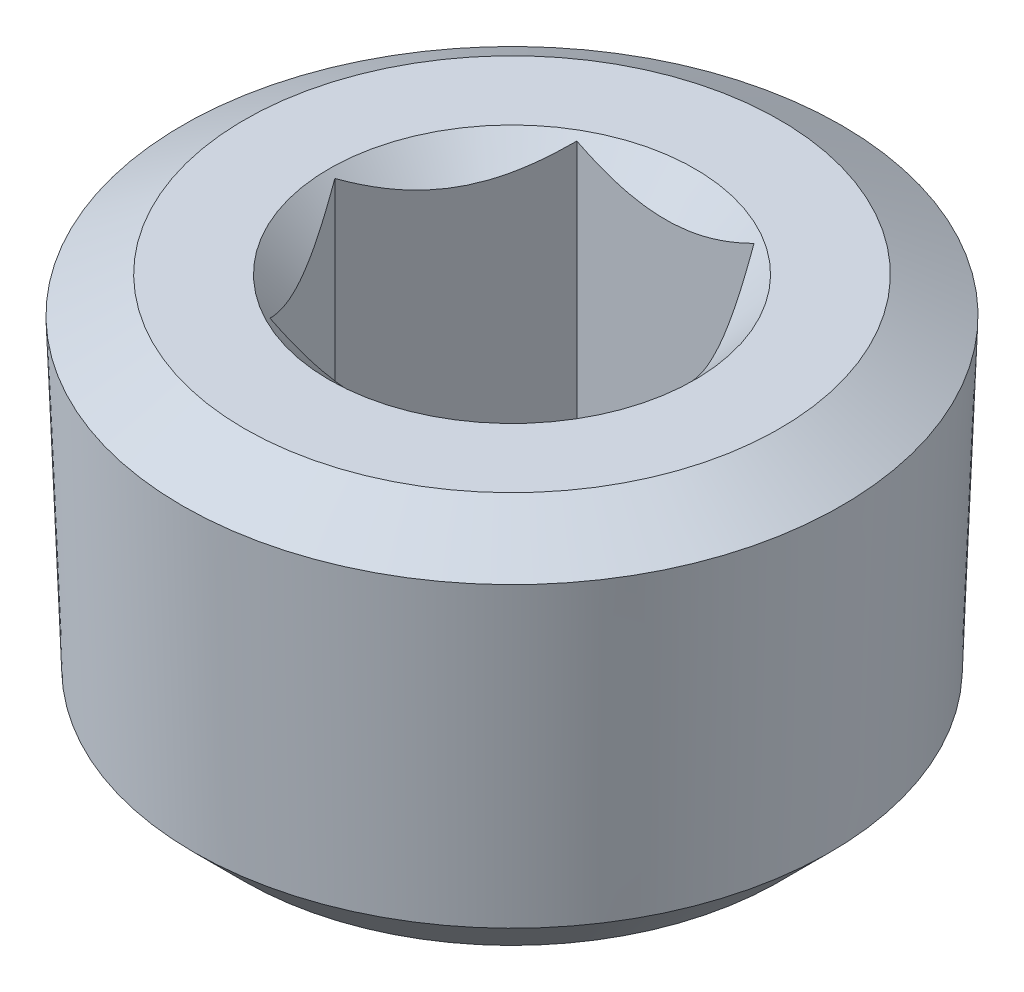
ISO-10303-21;
HEADER;
FILE_DESCRIPTION(('STEP AP214'),'2;1');
FILE_NAME('part.step','',(''),(''),'','','');
FILE_SCHEMA(('AUTOMOTIVE_DESIGN { 1 0 10303 214 1 1 1 1 }'));
ENDSEC;
DATA;
#1=APPLICATION_CONTEXT('core data for automotive mechanical design processes');
#2=APPLICATION_PROTOCOL_DEFINITION('international standard','automotive_design',2000,#1);
#3=PRODUCT_CONTEXT('',#1,'mechanical');
#4=PRODUCT('Part','Part','',(#3));
#5=PRODUCT_RELATED_PRODUCT_CATEGORY('part','',(#4));
#6=PRODUCT_DEFINITION_FORMATION('','',#4);
#7=PRODUCT_DEFINITION_CONTEXT('part definition',#1,'design');
#8=PRODUCT_DEFINITION('design','',#6,#7);
#9=PRODUCT_DEFINITION_SHAPE('','',#8);
#10=(LENGTH_UNIT() NAMED_UNIT(*) SI_UNIT(.MILLI.,.METRE.));
#11=(NAMED_UNIT(*) PLANE_ANGLE_UNIT() SI_UNIT($,.RADIAN.));
#12=(NAMED_UNIT(*) SI_UNIT($,.STERADIAN.) SOLID_ANGLE_UNIT());
#13=UNCERTAINTY_MEASURE_WITH_UNIT(LENGTH_MEASURE(1.E-05),#10,'distance_accuracy_value','');
#14=(GEOMETRIC_REPRESENTATION_CONTEXT(3) GLOBAL_UNCERTAINTY_ASSIGNED_CONTEXT((#13)) GLOBAL_UNIT_ASSIGNED_CONTEXT((#10,
#11,#12)) REPRESENTATION_CONTEXT('',''));
#15=CARTESIAN_POINT('',(0.,0.,0.));
#16=DIRECTION('',(0.,0.,1.));
#17=DIRECTION('',(1.,0.,0.));
#18=AXIS2_PLACEMENT_3D('',#15,#16,#17);
#19=CARTESIAN_POINT('',(0.,0.,0.));
#20=DIRECTION('',(0.,1.,0.));
#21=DIRECTION('',(0.,0.,1.));
#22=AXIS2_PLACEMENT_3D('',#19,#20,#21);
#23=PLANE('',#22);
#24=CARTESIAN_POINT('',(0.,0.,0.));
#25=DIRECTION('',(0.,1.,0.));
#26=DIRECTION('',(0.,0.,1.));
#27=AXIS2_PLACEMENT_3D('',#24,#25,#26);
#28=CIRCLE('',#27,4.7371);
#29=CARTESIAN_POINT('',(0.,0.,4.7371));
#30=VERTEX_POINT('',#29);
#31=EDGE_CURVE('E244',#30,#30,#28,.T.);
#32=ORIENTED_EDGE('',*,*,#31,.F.);
#33=EDGE_LOOP('',(#32));
#34=FACE_BOUND('',#33,.T.);
#35=CARTESIAN_POINT('',(0.,0.,0.));
#36=DIRECTION('',(0.,1.,0.));
#37=DIRECTION('',(0.,0.,1.));
#38=AXIS2_PLACEMENT_3D('',#35,#36,#37);
#39=CIRCLE('',#38,6.93208046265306);
#40=CARTESIAN_POINT('',(0.,0.,6.93208046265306));
#41=VERTEX_POINT('',#40);
#42=EDGE_CURVE('E12',#41,#41,#39,.T.);
#43=ORIENTED_EDGE('',*,*,#42,.T.);
#44=EDGE_LOOP('',(#43));
#45=FACE_BOUND('',#44,.T.);
#46=ADVANCED_FACE('F33',(#34,#45),#23,.T.);
#47=CARTESIAN_POINT('',(0.,0.,0.));
#48=DIRECTION('',(0.,-1.,0.));
#49=DIRECTION('',(0.,0.,-1.));
#50=AXIS2_PLACEMENT_3D('',#47,#48,#49);
#51=CONICAL_SURFACE('',#50,6.93208046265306,1.0471975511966);
#52=CARTESIAN_POINT('',(0.,-0.927571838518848,0.));
#53=DIRECTION('',(0.,1.,0.));
#54=DIRECTION('',(0.,0.,1.));
#55=AXIS2_PLACEMENT_3D('',#52,#53,#54);
#56=CIRCLE('',#55,8.53868201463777);
#57=CARTESIAN_POINT('',(0.,-0.927571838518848,8.53868201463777));
#58=VERTEX_POINT('',#57);
#59=EDGE_CURVE('E40',#58,#58,#56,.T.);
#60=ORIENTED_EDGE('',*,*,#59,.T.);
#61=EDGE_LOOP('',(#60));
#62=FACE_BOUND('',#61,.T.);
#63=ORIENTED_EDGE('',*,*,#42,.F.);
#64=EDGE_LOOP('',(#63));
#65=FACE_BOUND('',#64,.T.);
#66=ADVANCED_FACE('F234',(#62,#65),#51,.T.);
#67=CARTESIAN_POINT('',(0.,-0.927571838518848,0.));
#68=DIRECTION('',(0.,1.,0.));
#69=DIRECTION('',(0.,0.,1.));
#70=AXIS2_PLACEMENT_3D('',#67,#68,#69);
#71=CONICAL_SURFACE('',#70,8.53868201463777,0.0364424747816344);
#72=CARTESIAN_POINT('',(0.,-8.84194555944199,0.));
#73=DIRECTION('',(0.,1.,0.));
#74=DIRECTION('',(0.,0.,1.));
#75=AXIS2_PLACEMENT_3D('',#72,#73,#74);
#76=CIRCLE('',#75,8.25013490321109);
#77=CARTESIAN_POINT('',(0.,-8.84194555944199,8.25013490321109));
#78=VERTEX_POINT('',#77);
#79=EDGE_CURVE('E252',#78,#78,#76,.T.);
#80=ORIENTED_EDGE('',*,*,#79,.T.);
#81=EDGE_LOOP('',(#80));
#82=FACE_BOUND('',#81,.T.);
#83=ORIENTED_EDGE('',*,*,#59,.F.);
#84=EDGE_LOOP('',(#83));
#85=FACE_BOUND('',#84,.T.);
#86=ADVANCED_FACE('F239',(#82,#85),#71,.T.);
#87=CARTESIAN_POINT('',(0.,-8.84194555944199,0.));
#88=DIRECTION('',(0.,1.,0.));
#89=DIRECTION('',(0.,0.,1.));
#90=AXIS2_PLACEMENT_3D('',#87,#88,#89);
#91=CONICAL_SURFACE('',#90,8.25013490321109,0.785398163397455);
#92=CARTESIAN_POINT('',(0.,-10.16,0.));
#93=DIRECTION('',(0.,1.,0.));
#94=DIRECTION('',(0.,0.,1.));
#95=AXIS2_PLACEMENT_3D('',#92,#93,#94);
#96=CIRCLE('',#95,6.93208046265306);
#97=CARTESIAN_POINT('',(0.,-10.16,6.93208046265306));
#98=VERTEX_POINT('',#97);
#99=EDGE_CURVE('E248',#98,#98,#96,.T.);
#100=ORIENTED_EDGE('',*,*,#99,.T.);
#101=EDGE_LOOP('',(#100));
#102=FACE_BOUND('',#101,.T.);
#103=ORIENTED_EDGE('',*,*,#79,.F.);
#104=EDGE_LOOP('',(#103));
#105=FACE_BOUND('',#104,.T.);
#106=ADVANCED_FACE('F263',(#102,#105),#91,.T.);
#107=CARTESIAN_POINT('',(-6.93208046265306,-10.16,0.));
#108=DIRECTION('',(0.,-1.,0.));
#109=DIRECTION('',(0.,0.,-1.));
#110=AXIS2_PLACEMENT_3D('',#107,#108,#109);
#111=PLANE('',#110);
#112=ORIENTED_EDGE('',*,*,#99,.F.);
#113=EDGE_LOOP('',(#112));
#114=FACE_BOUND('',#113,.T.);
#115=ADVANCED_FACE('F177',(#114),#111,.T.);
#116=CARTESIAN_POINT('',(0.,0.,0.));
#117=DIRECTION('',(0.,1.,0.));
#118=DIRECTION('',(0.,0.,1.));
#119=AXIS2_PLACEMENT_3D('',#116,#117,#118);
#120=CONICAL_SURFACE('',#119,4.7371,0.785398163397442);
#121=CARTESIAN_POINT('',(-4.84909764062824,1.53308085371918,3.9751));
#122=CARTESIAN_POINT('',(-4.73217167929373,1.44267539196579,3.9751));
#123=CARTESIAN_POINT('',(-4.61462251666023,1.3530634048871,3.9751));
#124=CARTESIAN_POINT('',(-4.37802066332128,1.17579084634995,3.9751));
#125=CARTESIAN_POINT('',(-4.25896762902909,1.08813073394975,3.9751));
#126=CARTESIAN_POINT('',(-4.01823171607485,0.914502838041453,3.9751));
#127=CARTESIAN_POINT('',(-3.89653564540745,0.828553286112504,3.9751));
#128=CARTESIAN_POINT('',(-3.65113000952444,0.659588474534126,3.9751));
#129=CARTESIAN_POINT('',(-3.52742058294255,0.576573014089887,3.9751));
#130=CARTESIAN_POINT('',(-3.26950382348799,0.408855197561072,3.9751));
#131=CARTESIAN_POINT('',(-3.13513782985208,0.324395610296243,3.9751));
#132=CARTESIAN_POINT('',(-2.86324687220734,0.160636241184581,3.9751));
#133=CARTESIAN_POINT('',(-2.72572137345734,0.0813373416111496,3.9751));
#134=CARTESIAN_POINT('',(-2.44745996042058,-0.0704182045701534,3.9751));
#135=CARTESIAN_POINT('',(-2.30673507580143,-0.142894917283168,3.9751));
#136=CARTESIAN_POINT('',(-2.02127023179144,-0.279382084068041,3.9751));
#137=CARTESIAN_POINT('',(-1.87653222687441,-0.343396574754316,3.9751));
#138=CARTESIAN_POINT('',(-1.5978890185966,-0.454566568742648,3.9751));
#139=CARTESIAN_POINT('',(-1.46441051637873,-0.502780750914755,3.9751));
#140=CARTESIAN_POINT('',(-1.19400195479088,-0.588529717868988,3.9751));
#141=CARTESIAN_POINT('',(-1.05707168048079,-0.626063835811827,3.9751));
#142=CARTESIAN_POINT('',(-0.782993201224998,-0.687773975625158,3.9751));
#143=CARTESIAN_POINT('',(-0.645901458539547,-0.712196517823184,3.9751));
#144=CARTESIAN_POINT('',(-0.369949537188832,-0.747165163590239,3.9751));
#145=CARTESIAN_POINT('',(-0.2310897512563,-0.757714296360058,3.9751));
#146=CARTESIAN_POINT('',(0.0405804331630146,-0.764005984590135,3.9751));
#147=CARTESIAN_POINT('',(0.173375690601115,-0.760406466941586,3.9751));
#148=CARTESIAN_POINT('',(0.437956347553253,-0.740123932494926,3.9751));
#149=CARTESIAN_POINT('',(0.569741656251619,-0.723439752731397,3.9751));
#150=CARTESIAN_POINT('',(0.833584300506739,-0.677656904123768,3.9751));
#151=CARTESIAN_POINT('',(0.965602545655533,-0.648336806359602,3.9751));
#152=CARTESIAN_POINT('',(1.22672185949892,-0.578926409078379,3.9751));
#153=CARTESIAN_POINT('',(1.35582307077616,-0.538836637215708,3.9751));
#154=CARTESIAN_POINT('',(1.61707549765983,-0.447503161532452,3.9751));
#155=CARTESIAN_POINT('',(1.74906788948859,-0.395810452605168,3.9751));
#156=CARTESIAN_POINT('',(2.00966445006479,-0.284428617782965,3.9751));
#157=CARTESIAN_POINT('',(2.13826707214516,-0.224735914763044,3.9751));
#158=CARTESIAN_POINT('',(2.39268673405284,-0.0987689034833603,3.9751));
#159=CARTESIAN_POINT('',(2.51849370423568,-0.032474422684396,3.9751));
#160=CARTESIAN_POINT('',(2.76722744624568,0.105238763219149,3.9751));
#161=CARTESIAN_POINT('',(2.89015465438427,0.176656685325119,3.9751));
#162=CARTESIAN_POINT('',(3.12750338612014,0.319994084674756,3.9751));
#163=CARTESIAN_POINT('',(3.24204539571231,0.391715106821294,3.9751));
#164=CARTESIAN_POINT('',(3.46916126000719,0.538217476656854,3.9751));
#165=CARTESIAN_POINT('',(3.58173496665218,0.612999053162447,3.9751));
#166=CARTESIAN_POINT('',(3.80426855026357,0.764470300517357,3.9751));
#167=CARTESIAN_POINT('',(3.91424213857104,0.841139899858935,3.9751));
#168=CARTESIAN_POINT('',(4.13267949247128,0.996540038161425,3.9751));
#169=CARTESIAN_POINT('',(4.24114366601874,1.07527000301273,3.9751));
#170=CARTESIAN_POINT('',(4.34897443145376,1.15484353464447,3.9751));
#171=B_SPLINE_CURVE_WITH_KNOTS('',3,(#121,#122,#123,#124,#125,#126,#127,#128,#129,#130,#131,
#132,#133,#134,#135,#136,#137,#138,#139,#140,#141,#142,#143,#144,#145,#146,#147,#148,#149,#150,
#151,#152,#153,#154,#155,#156,#157,#158,#159,#160,#161,#162,#163,#164,#165,#166,#167,#168,#169,
#170),.UNSPECIFIED.,.F.,.F.,(4,2,2,2,2,2,2,2,2,2,2,2,2,2,2,2,2,2,2,2,2,2,2,2,4),(0.,
0.443407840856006,0.886918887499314,1.33384544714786,1.78074136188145,2.25676766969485,
2.73287514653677,3.20753536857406,3.6819683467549,4.10736140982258,4.53278102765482,
4.94989388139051,5.36691564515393,5.76478013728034,6.16267999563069,6.56785572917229,
6.97301161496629,7.39794831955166,7.82307566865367,8.24954441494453,8.67594812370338,
9.08132177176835,9.48672578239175,9.88888385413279,10.2909310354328),.UNSPECIFIED.);
#172=CARTESIAN_POINT('',(2.29502505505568,-0.14704988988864,3.9751));
#173=VERTEX_POINT('',#172);
#174=CARTESIAN_POINT('',(-2.29502505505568,-0.14704988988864,3.9751));
#175=VERTEX_POINT('',#174);
#176=EDGE_CURVE('E47',#173,#175,#171,.F.);
#177=ORIENTED_EDGE('',*,*,#176,.T.);
#178=CARTESIAN_POINT('',(-2.29490958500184,-0.146934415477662,3.9753));
#179=CARTESIAN_POINT('',(-2.33437312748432,-0.186393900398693,3.90694713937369));
#180=CARTESIAN_POINT('',(-2.37413865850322,-0.224642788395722,3.838071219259));
#181=CARTESIAN_POINT('',(-2.45433590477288,-0.298350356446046,3.69916551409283));
#182=CARTESIAN_POINT('',(-2.49476796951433,-0.333807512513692,3.62913512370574));
#183=CARTESIAN_POINT('',(-2.6175329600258,-0.435740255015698,3.41649992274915));
#184=CARTESIAN_POINT('',(-2.70090926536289,-0.49734220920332,3.27208792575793));
#185=CARTESIAN_POINT('',(-2.86901166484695,-0.602838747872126,2.98092602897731));
#186=CARTESIAN_POINT('',(-2.95369529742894,-0.646998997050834,2.83424967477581));
#187=CARTESIAN_POINT('',(-3.12493250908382,-0.715042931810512,2.53765812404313));
#188=CARTESIAN_POINT('',(-3.21148084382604,-0.738977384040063,2.38775201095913));
#189=CARTESIAN_POINT('',(-3.36064344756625,-0.760571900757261,2.12939480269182));
#190=CARTESIAN_POINT('',(-3.42306553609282,-0.763767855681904,2.02127657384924));
#191=CARTESIAN_POINT('',(-3.54780839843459,-0.758380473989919,1.80521559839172));
#192=CARTESIAN_POINT('',(-3.61012912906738,-0.7497930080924,1.69727292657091));
#193=CARTESIAN_POINT('',(-3.73418008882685,-0.721328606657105,1.48241036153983));
#194=CARTESIAN_POINT('',(-3.79590957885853,-0.701439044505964,1.37549174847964));
#195=CARTESIAN_POINT('',(-3.9183083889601,-0.651456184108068,1.16349079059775));
#196=CARTESIAN_POINT('',(-3.97897778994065,-0.621363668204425,1.05840830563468));
#197=CARTESIAN_POINT('',(-4.08668064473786,-0.559451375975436,0.87186148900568));
#198=CARTESIAN_POINT('',(-4.13395255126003,-0.529259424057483,0.789984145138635));
#199=CARTESIAN_POINT('',(-4.22764774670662,-0.464009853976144,0.627699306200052));
#200=CARTESIAN_POINT('',(-4.27407100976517,-0.42895208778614,0.54729185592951));
#201=CARTESIAN_POINT('',(-4.36592265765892,-0.35475679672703,0.388200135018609));
#202=CARTESIAN_POINT('',(-4.41135365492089,-0.315632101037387,0.309511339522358));
#203=CARTESIAN_POINT('',(-4.50137431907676,-0.233816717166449,0.153590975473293));
#204=CARTESIAN_POINT('',(-4.54596448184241,-0.191128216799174,0.0763585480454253));
#205=CARTESIAN_POINT('',(-4.5901655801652,-0.14693441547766,-0.000199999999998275));
#206=B_SPLINE_CURVE_WITH_KNOTS('',3,(#178,#179,#180,#181,#182,#183,#184,#185,#186,#187,#188,
#189,#190,#191,#192,#193,#194,#195,#196,#197,#198,#199,#200,#201,#202,#203,#204,#205),
.UNSPECIFIED.,.F.,.F.,(4,2,2,2,2,2,2,2,2,2,2,2,2,4),(0.,0.264704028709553,0.529551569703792,
1.0621063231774,1.58620390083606,2.10898205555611,2.48310879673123,2.85736667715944,
3.23204349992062,3.60669159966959,3.90429483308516,4.20190712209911,4.49860754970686,
4.79512715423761),.UNSPECIFIED.);
#207=CARTESIAN_POINT('',(-4.59005011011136,-0.147049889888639,0.));
#208=VERTEX_POINT('',#207);
#209=EDGE_CURVE('E119',#175,#208,#206,.T.);
#210=ORIENTED_EDGE('',*,*,#209,.T.);
#211=CARTESIAN_POINT('',(-4.5901655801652,-0.14693441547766,0.000200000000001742));
#212=CARTESIAN_POINT('',(-4.55070203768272,-0.186393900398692,-0.0681528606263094));
#213=CARTESIAN_POINT('',(-4.51093650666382,-0.224642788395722,-0.137028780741));
#214=CARTESIAN_POINT('',(-4.43073926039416,-0.298350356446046,-0.275934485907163));
#215=CARTESIAN_POINT('',(-4.39030719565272,-0.333807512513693,-0.345964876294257));
#216=CARTESIAN_POINT('',(-4.26754220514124,-0.435740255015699,-0.558600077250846));
#217=CARTESIAN_POINT('',(-4.18416589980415,-0.49734220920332,-0.703012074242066));
#218=CARTESIAN_POINT('',(-4.01606350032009,-0.602838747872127,-0.994173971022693));
#219=CARTESIAN_POINT('',(-3.9313798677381,-0.646998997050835,-1.14085032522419));
#220=CARTESIAN_POINT('',(-3.76014265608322,-0.715042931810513,-1.43744187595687));
#221=CARTESIAN_POINT('',(-3.673594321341,-0.738977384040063,-1.58734798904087));
#222=CARTESIAN_POINT('',(-3.52443171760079,-0.760571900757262,-1.84570519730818));
#223=CARTESIAN_POINT('',(-3.46200962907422,-0.763767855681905,-1.95382342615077));
#224=CARTESIAN_POINT('',(-3.33726676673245,-0.75838047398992,-2.16988440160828));
#225=CARTESIAN_POINT('',(-3.27494603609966,-0.749793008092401,-2.27782707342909));
#226=CARTESIAN_POINT('',(-3.15089507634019,-0.721328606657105,-2.49268963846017));
#227=CARTESIAN_POINT('',(-3.08916558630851,-0.701439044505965,-2.59960825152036));
#228=CARTESIAN_POINT('',(-2.96676677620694,-0.651456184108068,-2.81160920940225));
#229=CARTESIAN_POINT('',(-2.90609737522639,-0.621363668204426,-2.91669169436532));
#230=CARTESIAN_POINT('',(-2.79839452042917,-0.559451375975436,-3.10323851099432));
#231=CARTESIAN_POINT('',(-2.75112261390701,-0.529259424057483,-3.18511585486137));
#232=CARTESIAN_POINT('',(-2.65742741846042,-0.464009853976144,-3.34740069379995));
#233=CARTESIAN_POINT('',(-2.61100415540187,-0.42895208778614,-3.42780814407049));
#234=CARTESIAN_POINT('',(-2.51915250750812,-0.354756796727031,-3.58689986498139));
#235=CARTESIAN_POINT('',(-2.47372151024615,-0.315632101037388,-3.66558866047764));
#236=CARTESIAN_POINT('',(-2.38370084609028,-0.23381671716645,-3.82150902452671));
#237=CARTESIAN_POINT('',(-2.33911068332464,-0.191128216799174,-3.89874145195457));
#238=CARTESIAN_POINT('',(-2.29490958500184,-0.146934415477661,-3.9753));
#239=B_SPLINE_CURVE_WITH_KNOTS('',3,(#211,#212,#213,#214,#215,#216,#217,#218,#219,#220,#221,
#222,#223,#224,#225,#226,#227,#228,#229,#230,#231,#232,#233,#234,#235,#236,#237,#238),
.UNSPECIFIED.,.F.,.F.,(4,2,2,2,2,2,2,2,2,2,2,2,2,4),(0.,0.264704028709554,0.529551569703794,
1.0621063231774,1.58620390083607,2.10898205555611,2.48310879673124,2.85736667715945,
3.23204349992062,3.60669159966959,3.90429483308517,4.20190712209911,4.49860754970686,
4.79512715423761),.UNSPECIFIED.);
#240=CARTESIAN_POINT('',(-2.29502505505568,-0.147049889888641,-3.9751));
#241=VERTEX_POINT('',#240);
#242=EDGE_CURVE('E201',#208,#241,#239,.T.);
#243=ORIENTED_EDGE('',*,*,#242,.T.);
#244=CARTESIAN_POINT('',(-4.84909764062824,1.53308085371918,-3.9751));
#245=CARTESIAN_POINT('',(-4.73217167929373,1.4426753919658,-3.9751));
#246=CARTESIAN_POINT('',(-4.61462251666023,1.3530634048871,-3.9751));
#247=CARTESIAN_POINT('',(-4.37802066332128,1.17579084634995,-3.9751));
#248=CARTESIAN_POINT('',(-4.25896762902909,1.08813073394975,-3.9751));
#249=CARTESIAN_POINT('',(-4.01823171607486,0.914502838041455,-3.9751));
#250=CARTESIAN_POINT('',(-3.89653564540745,0.828553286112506,-3.9751));
#251=CARTESIAN_POINT('',(-3.65113000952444,0.659588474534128,-3.9751));
#252=CARTESIAN_POINT('',(-3.52742058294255,0.576573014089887,-3.9751));
#253=CARTESIAN_POINT('',(-3.26950382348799,0.408855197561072,-3.9751));
#254=CARTESIAN_POINT('',(-3.13513782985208,0.324395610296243,-3.9751));
#255=CARTESIAN_POINT('',(-2.86324687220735,0.160636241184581,-3.9751));
#256=CARTESIAN_POINT('',(-2.72572137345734,0.0813373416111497,-3.9751));
#257=CARTESIAN_POINT('',(-2.44745996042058,-0.0704182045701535,-3.9751));
#258=CARTESIAN_POINT('',(-2.30673507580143,-0.142894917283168,-3.9751));
#259=CARTESIAN_POINT('',(-2.02127023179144,-0.279382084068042,-3.9751));
#260=CARTESIAN_POINT('',(-1.87653222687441,-0.343396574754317,-3.9751));
#261=CARTESIAN_POINT('',(-1.5978890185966,-0.454566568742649,-3.9751));
#262=CARTESIAN_POINT('',(-1.46441051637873,-0.502780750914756,-3.9751));
#263=CARTESIAN_POINT('',(-1.19400195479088,-0.588529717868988,-3.9751));
#264=CARTESIAN_POINT('',(-1.05707168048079,-0.626063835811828,-3.9751));
#265=CARTESIAN_POINT('',(-0.782993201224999,-0.687773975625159,-3.9751));
#266=CARTESIAN_POINT('',(-0.645901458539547,-0.712196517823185,-3.9751));
#267=CARTESIAN_POINT('',(-0.369949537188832,-0.74716516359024,-3.9751));
#268=CARTESIAN_POINT('',(-0.2310897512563,-0.757714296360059,-3.9751));
#269=CARTESIAN_POINT('',(0.0405804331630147,-0.764005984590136,-3.9751));
#270=CARTESIAN_POINT('',(0.173375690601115,-0.760406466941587,-3.9751));
#271=CARTESIAN_POINT('',(0.437956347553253,-0.740123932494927,-3.9751));
#272=CARTESIAN_POINT('',(0.569741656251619,-0.723439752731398,-3.9751));
#273=CARTESIAN_POINT('',(0.83358430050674,-0.677656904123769,-3.9751));
#274=CARTESIAN_POINT('',(0.965602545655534,-0.648336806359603,-3.9751));
#275=CARTESIAN_POINT('',(1.22672185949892,-0.57892640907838,-3.9751));
#276=CARTESIAN_POINT('',(1.35582307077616,-0.538836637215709,-3.9751));
#277=CARTESIAN_POINT('',(1.61707549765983,-0.447503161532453,-3.9751));
#278=CARTESIAN_POINT('',(1.74906788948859,-0.395810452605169,-3.9751));
#279=CARTESIAN_POINT('',(2.00966445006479,-0.284428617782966,-3.9751));
#280=CARTESIAN_POINT('',(2.13826707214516,-0.224735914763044,-3.9751));
#281=CARTESIAN_POINT('',(2.39268673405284,-0.0987689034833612,-3.9751));
#282=CARTESIAN_POINT('',(2.51849370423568,-0.0324744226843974,-3.9751));
#283=CARTESIAN_POINT('',(2.76722744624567,0.105238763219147,-3.9751));
#284=CARTESIAN_POINT('',(2.89015465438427,0.176656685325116,-3.9751));
#285=CARTESIAN_POINT('',(3.12750338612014,0.319994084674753,-3.9751));
#286=CARTESIAN_POINT('',(3.2420453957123,0.391715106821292,-3.9751));
#287=CARTESIAN_POINT('',(3.46916126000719,0.538217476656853,-3.9751));
#288=CARTESIAN_POINT('',(3.58173496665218,0.612999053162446,-3.9751));
#289=CARTESIAN_POINT('',(3.80426855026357,0.764470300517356,-3.9751));
#290=CARTESIAN_POINT('',(3.91424213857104,0.841139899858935,-3.9751));
#291=CARTESIAN_POINT('',(4.13267949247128,0.996540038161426,-3.9751));
#292=CARTESIAN_POINT('',(4.24114366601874,1.07527000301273,-3.9751));
#293=CARTESIAN_POINT('',(4.34897443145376,1.15484353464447,-3.9751));
#294=B_SPLINE_CURVE_WITH_KNOTS('',3,(#244,#245,#246,#247,#248,#249,#250,#251,#252,#253,#254,
#255,#256,#257,#258,#259,#260,#261,#262,#263,#264,#265,#266,#267,#268,#269,#270,#271,#272,#273,
#274,#275,#276,#277,#278,#279,#280,#281,#282,#283,#284,#285,#286,#287,#288,#289,#290,#291,#292,
#293),.UNSPECIFIED.,.F.,.F.,(4,2,2,2,2,2,2,2,2,2,2,2,2,2,2,2,2,2,2,2,2,2,2,2,4),(0.,
0.443407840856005,0.886918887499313,1.33384544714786,1.78074136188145,2.25676766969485,
2.73287514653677,3.20753536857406,3.6819683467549,4.10736140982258,4.53278102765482,
4.94989388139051,5.36691564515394,5.76478013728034,6.1626799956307,6.56785572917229,
6.97301161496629,7.39794831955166,7.82307566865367,8.24954441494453,8.67594812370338,
9.08132177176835,9.48672578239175,9.88888385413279,10.2909310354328),.UNSPECIFIED.);
#295=CARTESIAN_POINT('',(2.29502505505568,-0.147049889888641,-3.9751));
#296=VERTEX_POINT('',#295);
#297=EDGE_CURVE('E194',#241,#296,#294,.T.);
#298=ORIENTED_EDGE('',*,*,#297,.T.);
#299=CARTESIAN_POINT('',(2.29490958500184,-0.146934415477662,-3.9753));
#300=CARTESIAN_POINT('',(2.33437312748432,-0.186393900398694,-3.90694713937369));
#301=CARTESIAN_POINT('',(2.37413865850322,-0.224642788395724,-3.838071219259));
#302=CARTESIAN_POINT('',(2.45433590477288,-0.298350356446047,-3.69916551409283));
#303=CARTESIAN_POINT('',(2.49476796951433,-0.333807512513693,-3.62913512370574));
#304=CARTESIAN_POINT('',(2.6175329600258,-0.435740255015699,-3.41649992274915));
#305=CARTESIAN_POINT('',(2.7009092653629,-0.497342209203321,-3.27208792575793));
#306=CARTESIAN_POINT('',(2.86901166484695,-0.602838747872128,-2.9809260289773));
#307=CARTESIAN_POINT('',(2.95369529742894,-0.646998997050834,-2.8342496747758));
#308=CARTESIAN_POINT('',(3.12493250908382,-0.715042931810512,-2.53765812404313));
#309=CARTESIAN_POINT('',(3.21148084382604,-0.738977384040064,-2.38775201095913));
#310=CARTESIAN_POINT('',(3.36064344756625,-0.760571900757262,-2.12939480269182));
#311=CARTESIAN_POINT('',(3.42306553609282,-0.763767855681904,-2.02127657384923));
#312=CARTESIAN_POINT('',(3.54780839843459,-0.758380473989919,-1.80521559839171));
#313=CARTESIAN_POINT('',(3.61012912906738,-0.7497930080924,-1.69727292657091));
#314=CARTESIAN_POINT('',(3.73418008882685,-0.721328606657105,-1.48241036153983));
#315=CARTESIAN_POINT('',(3.79590957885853,-0.701439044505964,-1.37549174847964));
#316=CARTESIAN_POINT('',(3.9183083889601,-0.651456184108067,-1.16349079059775));
#317=CARTESIAN_POINT('',(3.97897778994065,-0.621363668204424,-1.05840830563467));
#318=CARTESIAN_POINT('',(4.08668064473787,-0.559451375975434,-0.871861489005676));
#319=CARTESIAN_POINT('',(4.13395255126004,-0.529259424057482,-0.789984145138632));
#320=CARTESIAN_POINT('',(4.22764774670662,-0.464009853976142,-0.627699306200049));
#321=CARTESIAN_POINT('',(4.27407100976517,-0.428952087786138,-0.547291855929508));
#322=CARTESIAN_POINT('',(4.36592265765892,-0.354756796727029,-0.388200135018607));
#323=CARTESIAN_POINT('',(4.41135365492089,-0.315632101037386,-0.309511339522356));
#324=CARTESIAN_POINT('',(4.50137431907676,-0.233816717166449,-0.153590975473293));
#325=CARTESIAN_POINT('',(4.54596448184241,-0.191128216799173,-0.0763585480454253));
#326=CARTESIAN_POINT('',(4.5901655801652,-0.14693441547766,0.00019999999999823));
#327=B_SPLINE_CURVE_WITH_KNOTS('',3,(#299,#300,#301,#302,#303,#304,#305,#306,#307,#308,#309,
#310,#311,#312,#313,#314,#315,#316,#317,#318,#319,#320,#321,#322,#323,#324,#325,#326),
.UNSPECIFIED.,.F.,.F.,(4,2,2,2,2,2,2,2,2,2,2,2,2,4),(0.,0.264704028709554,0.529551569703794,
1.0621063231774,1.58620390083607,2.10898205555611,2.48310879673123,2.85736667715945,
3.23204349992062,3.60669159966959,3.90429483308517,4.20190712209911,4.49860754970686,
4.79512715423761),.UNSPECIFIED.);
#328=CARTESIAN_POINT('',(4.59005011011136,-0.147049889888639,0.));
#329=VERTEX_POINT('',#328);
#330=EDGE_CURVE('E187',#296,#329,#327,.T.);
#331=ORIENTED_EDGE('',*,*,#330,.T.);
#332=CARTESIAN_POINT('',(4.5901655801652,-0.14693441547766,-0.000200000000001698));
#333=CARTESIAN_POINT('',(4.55070203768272,-0.186393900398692,0.0681528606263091));
#334=CARTESIAN_POINT('',(4.51093650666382,-0.224642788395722,0.137028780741));
#335=CARTESIAN_POINT('',(4.43073926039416,-0.298350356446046,0.275934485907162));
#336=CARTESIAN_POINT('',(4.39030719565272,-0.333807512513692,0.345964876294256));
#337=CARTESIAN_POINT('',(4.26754220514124,-0.435740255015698,0.558600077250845));
#338=CARTESIAN_POINT('',(4.18416589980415,-0.49734220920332,0.703012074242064));
#339=CARTESIAN_POINT('',(4.01606350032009,-0.602838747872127,0.994173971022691));
#340=CARTESIAN_POINT('',(3.9313798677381,-0.646998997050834,1.14085032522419));
#341=CARTESIAN_POINT('',(3.76014265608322,-0.715042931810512,1.43744187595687));
#342=CARTESIAN_POINT('',(3.673594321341,-0.738977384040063,1.58734798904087));
#343=CARTESIAN_POINT('',(3.52443171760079,-0.760571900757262,1.84570519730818));
#344=CARTESIAN_POINT('',(3.46200962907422,-0.763767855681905,1.95382342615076));
#345=CARTESIAN_POINT('',(3.33726676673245,-0.75838047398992,2.16988440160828));
#346=CARTESIAN_POINT('',(3.27494603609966,-0.749793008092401,2.27782707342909));
#347=CARTESIAN_POINT('',(3.15089507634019,-0.721328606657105,2.49268963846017));
#348=CARTESIAN_POINT('',(3.08916558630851,-0.701439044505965,2.59960825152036));
#349=CARTESIAN_POINT('',(2.96676677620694,-0.651456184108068,2.81160920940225));
#350=CARTESIAN_POINT('',(2.9060973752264,-0.621363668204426,2.91669169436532));
#351=CARTESIAN_POINT('',(2.79839452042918,-0.559451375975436,3.10323851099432));
#352=CARTESIAN_POINT('',(2.75112261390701,-0.529259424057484,3.18511585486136));
#353=CARTESIAN_POINT('',(2.65742741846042,-0.464009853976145,3.34740069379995));
#354=CARTESIAN_POINT('',(2.61100415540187,-0.42895208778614,3.42780814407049));
#355=CARTESIAN_POINT('',(2.51915250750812,-0.35475679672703,3.58689986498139));
#356=CARTESIAN_POINT('',(2.47372151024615,-0.315632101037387,3.66558866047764));
#357=CARTESIAN_POINT('',(2.38370084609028,-0.23381671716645,3.82150902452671));
#358=CARTESIAN_POINT('',(2.33911068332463,-0.191128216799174,3.89874145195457));
#359=CARTESIAN_POINT('',(2.29490958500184,-0.14693441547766,3.9753));
#360=B_SPLINE_CURVE_WITH_KNOTS('',3,(#332,#333,#334,#335,#336,#337,#338,#339,#340,#341,#342,
#343,#344,#345,#346,#347,#348,#349,#350,#351,#352,#353,#354,#355,#356,#357,#358,#359),
.UNSPECIFIED.,.F.,.F.,(4,2,2,2,2,2,2,2,2,2,2,2,2,4),(0.,0.264704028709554,0.529551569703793,
1.0621063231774,1.58620390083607,2.10898205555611,2.48310879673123,2.85736667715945,
3.23204349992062,3.60669159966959,3.90429483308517,4.20190712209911,4.49860754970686,
4.79512715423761),.UNSPECIFIED.);
#361=EDGE_CURVE('E163',#329,#173,#360,.T.);
#362=ORIENTED_EDGE('',*,*,#361,.T.);
#363=EDGE_LOOP('',(#177,#210,#243,#298,#331,#362));
#364=FACE_BOUND('',#363,.T.);
#365=ORIENTED_EDGE('',*,*,#31,.T.);
#366=EDGE_LOOP('',(#365));
#367=FACE_BOUND('',#366,.T.);
#368=ADVANCED_FACE('F172',(#364,#367),#120,.F.);
#369=CARTESIAN_POINT('',(-4.59005011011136,-6.858,0.));
#370=DIRECTION('',(-0.866025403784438,0.,0.5));
#371=DIRECTION('',(0.5,0.,0.866025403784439));
#372=AXIS2_PLACEMENT_3D('',#369,#370,#371);
#373=PLANE('',#372);
#374=DIRECTION('',(0.,1.,0.));
#375=VECTOR('',#374,1.);
#376=CARTESIAN_POINT('',(-2.29502505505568,-6.858,3.9751));
#377=LINE('',#376,#375);
#378=CARTESIAN_POINT('',(-2.29502505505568,-6.858,3.9751));
#379=VERTEX_POINT('',#378);
#380=EDGE_CURVE('E116',#379,#175,#377,.T.);
#381=ORIENTED_EDGE('',*,*,#380,.F.);
#382=DIRECTION('',(0.5,0.,0.866025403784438));
#383=VECTOR('',#382,1.);
#384=CARTESIAN_POINT('',(-4.59005011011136,-6.858,0.));
#385=LINE('',#384,#383);
#386=CARTESIAN_POINT('',(-3.44253758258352,-6.858,1.98755));
#387=VERTEX_POINT('',#386);
#388=EDGE_CURVE('E103',#387,#379,#385,.T.);
#389=ORIENTED_EDGE('',*,*,#388,.F.);
#390=CARTESIAN_POINT('',(-4.59005011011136,-6.858,0.));
#391=VERTEX_POINT('',#390);
#392=EDGE_CURVE('E113',#391,#387,#385,.T.);
#393=ORIENTED_EDGE('',*,*,#392,.F.);
#394=DIRECTION('',(0.,1.,0.));
#395=VECTOR('',#394,1.);
#396=CARTESIAN_POINT('',(-4.59005011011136,-6.858,0.));
#397=LINE('',#396,#395);
#398=EDGE_CURVE('E143',#391,#208,#397,.T.);
#399=ORIENTED_EDGE('',*,*,#398,.T.);
#400=ORIENTED_EDGE('',*,*,#209,.F.);
#401=EDGE_LOOP('',(#381,#389,#393,#399,#400));
#402=FACE_BOUND('',#401,.T.);
#403=ADVANCED_FACE('F117',(#402),#373,.F.);
#404=CARTESIAN_POINT('',(-2.29502505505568,-6.858,-3.9751));
#405=DIRECTION('',(-0.866025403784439,0.,-0.5));
#406=DIRECTION('',(-0.5,0.,0.866025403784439));
#407=AXIS2_PLACEMENT_3D('',#404,#405,#406);
#408=PLANE('',#407);
#409=ORIENTED_EDGE('',*,*,#398,.F.);
#410=DIRECTION('',(-0.5,0.,0.866025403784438));
#411=VECTOR('',#410,1.);
#412=CARTESIAN_POINT('',(-2.29502505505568,-6.858,-3.9751));
#413=LINE('',#412,#411);
#414=CARTESIAN_POINT('',(-3.44253758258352,-6.858,-1.98755));
#415=VERTEX_POINT('',#414);
#416=EDGE_CURVE('E140',#415,#391,#413,.T.);
#417=ORIENTED_EDGE('',*,*,#416,.F.);
#418=CARTESIAN_POINT('',(-2.29502505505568,-6.858,-3.9751));
#419=VERTEX_POINT('',#418);
#420=EDGE_CURVE('E122',#419,#415,#413,.T.);
#421=ORIENTED_EDGE('',*,*,#420,.F.);
#422=DIRECTION('',(0.,1.,0.));
#423=VECTOR('',#422,1.);
#424=CARTESIAN_POINT('',(-2.29502505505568,-6.858,-3.9751));
#425=LINE('',#424,#423);
#426=EDGE_CURVE('E145',#419,#241,#425,.T.);
#427=ORIENTED_EDGE('',*,*,#426,.T.);
#428=ORIENTED_EDGE('',*,*,#242,.F.);
#429=EDGE_LOOP('',(#409,#417,#421,#427,#428));
#430=FACE_BOUND('',#429,.T.);
#431=ADVANCED_FACE('F212',(#430),#408,.F.);
#432=CARTESIAN_POINT('',(2.29502505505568,-6.858,-3.9751));
#433=DIRECTION('',(0.,0.,-1.));
#434=DIRECTION('',(-1.,0.,0.));
#435=AXIS2_PLACEMENT_3D('',#432,#433,#434);
#436=PLANE('',#435);
#437=ORIENTED_EDGE('',*,*,#426,.F.);
#438=DIRECTION('',(-1.,0.,0.));
#439=VECTOR('',#438,1.);
#440=CARTESIAN_POINT('',(2.29502505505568,-6.858,-3.9751));
#441=LINE('',#440,#439);
#442=CARTESIAN_POINT('',(0.,-6.858,-3.9751));
#443=VERTEX_POINT('',#442);
#444=EDGE_CURVE('E136',#443,#419,#441,.T.);
#445=ORIENTED_EDGE('',*,*,#444,.F.);
#446=CARTESIAN_POINT('',(2.29502505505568,-6.858,-3.9751));
#447=VERTEX_POINT('',#446);
#448=EDGE_CURVE('E137',#447,#443,#441,.T.);
#449=ORIENTED_EDGE('',*,*,#448,.F.);
#450=DIRECTION('',(0.,1.,0.));
#451=VECTOR('',#450,1.);
#452=CARTESIAN_POINT('',(2.29502505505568,-6.858,-3.9751));
#453=LINE('',#452,#451);
#454=EDGE_CURVE('E148',#447,#296,#453,.T.);
#455=ORIENTED_EDGE('',*,*,#454,.T.);
#456=ORIENTED_EDGE('',*,*,#297,.F.);
#457=EDGE_LOOP('',(#437,#445,#449,#455,#456));
#458=FACE_BOUND('',#457,.T.);
#459=ADVANCED_FACE('F216',(#458),#436,.F.);
#460=CARTESIAN_POINT('',(4.59005011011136,-6.858,0.));
#461=DIRECTION('',(0.866025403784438,0.,-0.5));
#462=DIRECTION('',(-0.5,0.,-0.866025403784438));
#463=AXIS2_PLACEMENT_3D('',#460,#461,#462);
#464=PLANE('',#463);
#465=ORIENTED_EDGE('',*,*,#454,.F.);
#466=DIRECTION('',(-0.5,0.,-0.866025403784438));
#467=VECTOR('',#466,1.);
#468=CARTESIAN_POINT('',(4.59005011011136,-6.858,0.));
#469=LINE('',#468,#467);
#470=CARTESIAN_POINT('',(3.44253758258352,-6.858,-1.98755));
#471=VERTEX_POINT('',#470);
#472=EDGE_CURVE('E132',#471,#447,#469,.T.);
#473=ORIENTED_EDGE('',*,*,#472,.F.);
#474=CARTESIAN_POINT('',(4.59005011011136,-6.858,0.));
#475=VERTEX_POINT('',#474);
#476=EDGE_CURVE('E133',#475,#471,#469,.T.);
#477=ORIENTED_EDGE('',*,*,#476,.F.);
#478=DIRECTION('',(0.,1.,0.));
#479=VECTOR('',#478,1.);
#480=CARTESIAN_POINT('',(4.59005011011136,-6.858,0.));
#481=LINE('',#480,#479);
#482=EDGE_CURVE('E151',#475,#329,#481,.T.);
#483=ORIENTED_EDGE('',*,*,#482,.T.);
#484=ORIENTED_EDGE('',*,*,#330,.F.);
#485=EDGE_LOOP('',(#465,#473,#477,#483,#484));
#486=FACE_BOUND('',#485,.T.);
#487=ADVANCED_FACE('F220',(#486),#464,.F.);
#488=CARTESIAN_POINT('',(2.29502505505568,-6.858,3.9751));
#489=DIRECTION('',(0.866025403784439,0.,0.5));
#490=DIRECTION('',(0.5,0.,-0.866025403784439));
#491=AXIS2_PLACEMENT_3D('',#488,#489,#490);
#492=PLANE('',#491);
#493=ORIENTED_EDGE('',*,*,#482,.F.);
#494=DIRECTION('',(0.5,0.,-0.866025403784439));
#495=VECTOR('',#494,1.);
#496=CARTESIAN_POINT('',(2.29502505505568,-6.858,3.9751));
#497=LINE('',#496,#495);
#498=CARTESIAN_POINT('',(3.44253758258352,-6.858,1.98755));
#499=VERTEX_POINT('',#498);
#500=EDGE_CURVE('E128',#499,#475,#497,.T.);
#501=ORIENTED_EDGE('',*,*,#500,.F.);
#502=CARTESIAN_POINT('',(2.29502505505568,-6.858,3.9751));
#503=VERTEX_POINT('',#502);
#504=EDGE_CURVE('E55',#503,#499,#497,.T.);
#505=ORIENTED_EDGE('',*,*,#504,.F.);
#506=DIRECTION('',(0.,1.,0.));
#507=VECTOR('',#506,1.);
#508=CARTESIAN_POINT('',(2.29502505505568,-6.858,3.9751));
#509=LINE('',#508,#507);
#510=EDGE_CURVE('E121',#503,#173,#509,.T.);
#511=ORIENTED_EDGE('',*,*,#510,.T.);
#512=ORIENTED_EDGE('',*,*,#361,.F.);
#513=EDGE_LOOP('',(#493,#501,#505,#511,#512));
#514=FACE_BOUND('',#513,.T.);
#515=ADVANCED_FACE('F224',(#514),#492,.F.);
#516=CARTESIAN_POINT('',(-2.29502505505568,-6.858,3.9751));
#517=DIRECTION('',(0.,0.,1.));
#518=DIRECTION('',(1.,0.,0.));
#519=AXIS2_PLACEMENT_3D('',#516,#517,#518);
#520=PLANE('',#519);
#521=ORIENTED_EDGE('',*,*,#510,.F.);
#522=DIRECTION('',(1.,0.,0.));
#523=VECTOR('',#522,1.);
#524=CARTESIAN_POINT('',(-2.29502505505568,-6.858,3.9751));
#525=LINE('',#524,#523);
#526=CARTESIAN_POINT('',(0.,-6.858,3.9751));
#527=VERTEX_POINT('',#526);
#528=EDGE_CURVE('E127',#527,#503,#525,.T.);
#529=ORIENTED_EDGE('',*,*,#528,.F.);
#530=EDGE_CURVE('E107',#379,#527,#525,.T.);
#531=ORIENTED_EDGE('',*,*,#530,.F.);
#532=ORIENTED_EDGE('',*,*,#380,.T.);
#533=ORIENTED_EDGE('',*,*,#176,.F.);
#534=EDGE_LOOP('',(#521,#529,#531,#532,#533));
#535=FACE_BOUND('',#534,.T.);
#536=ADVANCED_FACE('F126',(#535),#520,.F.);
#537=CARTESIAN_POINT('',(0.,-6.858,0.));
#538=DIRECTION('',(0.,1.,0.));
#539=DIRECTION('',(0.,0.,1.));
#540=AXIS2_PLACEMENT_3D('',#537,#538,#539);
#541=PLANE('',#540);
#542=CARTESIAN_POINT('',(0.,-6.858,0.));
#543=DIRECTION('',(0.,1.,0.));
#544=DIRECTION('',(0.,0.,1.));
#545=AXIS2_PLACEMENT_3D('',#542,#543,#544);
#546=CIRCLE('',#545,3.9751);
#547=EDGE_CURVE('E109',#387,#527,#546,.T.);
#548=ORIENTED_EDGE('',*,*,#547,.F.);
#549=ORIENTED_EDGE('',*,*,#388,.T.);
#550=ORIENTED_EDGE('',*,*,#530,.T.);
#551=EDGE_LOOP('',(#548,#549,#550));
#552=FACE_BOUND('',#551,.T.);
#553=ADVANCED_FACE('F105',(#552),#541,.T.);
#554=EDGE_CURVE('E414',#415,#387,#546,.T.);
#555=ORIENTED_EDGE('',*,*,#554,.F.);
#556=ORIENTED_EDGE('',*,*,#416,.T.);
#557=ORIENTED_EDGE('',*,*,#392,.T.);
#558=EDGE_LOOP('',(#555,#556,#557));
#559=FACE_BOUND('',#558,.T.);
#560=ADVANCED_FACE('F320',(#559),#541,.T.);
#561=EDGE_CURVE('E425',#443,#415,#546,.T.);
#562=ORIENTED_EDGE('',*,*,#561,.F.);
#563=ORIENTED_EDGE('',*,*,#444,.T.);
#564=ORIENTED_EDGE('',*,*,#420,.T.);
#565=EDGE_LOOP('',(#562,#563,#564));
#566=FACE_BOUND('',#565,.T.);
#567=ADVANCED_FACE('F329',(#566),#541,.T.);
#568=EDGE_CURVE('E426',#471,#443,#546,.T.);
#569=ORIENTED_EDGE('',*,*,#568,.F.);
#570=ORIENTED_EDGE('',*,*,#472,.T.);
#571=ORIENTED_EDGE('',*,*,#448,.T.);
#572=EDGE_LOOP('',(#569,#570,#571));
#573=FACE_BOUND('',#572,.T.);
#574=ADVANCED_FACE('F338',(#573),#541,.T.);
#575=EDGE_CURVE('E255',#499,#471,#546,.T.);
#576=ORIENTED_EDGE('',*,*,#575,.F.);
#577=ORIENTED_EDGE('',*,*,#500,.T.);
#578=ORIENTED_EDGE('',*,*,#476,.T.);
#579=EDGE_LOOP('',(#576,#577,#578));
#580=FACE_BOUND('',#579,.T.);
#581=ADVANCED_FACE('F347',(#580),#541,.T.);
#582=EDGE_CURVE('E249',#527,#499,#546,.T.);
#583=ORIENTED_EDGE('',*,*,#582,.F.);
#584=ORIENTED_EDGE('',*,*,#528,.T.);
#585=ORIENTED_EDGE('',*,*,#504,.T.);
#586=EDGE_LOOP('',(#583,#584,#585));
#587=FACE_BOUND('',#586,.T.);
#588=ADVANCED_FACE('F321',(#587),#541,.T.);
#589=CARTESIAN_POINT('',(-2.70691903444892,-7.62,0.));
#590=DIRECTION('',(0.,-1.,0.));
#591=DIRECTION('',(0.,0.,-1.));
#592=AXIS2_PLACEMENT_3D('',#589,#590,#591);
#593=PLANE('',#592);
#594=CARTESIAN_POINT('',(0.,-7.62,0.));
#595=DIRECTION('',(0.,1.,0.));
#596=DIRECTION('',(0.,0.,1.));
#597=AXIS2_PLACEMENT_3D('',#594,#595,#596);
#598=CIRCLE('',#597,2.70691903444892);
#599=CARTESIAN_POINT('',(0.,-7.62,2.70691903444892));
#600=VERTEX_POINT('',#599);
#601=EDGE_CURVE('E413',#600,#600,#598,.T.);
#602=ORIENTED_EDGE('',*,*,#601,.T.);
#603=EDGE_LOOP('',(#602));
#604=FACE_BOUND('',#603,.T.);
#605=ADVANCED_FACE('F364',(#604),#593,.F.);
#606=CARTESIAN_POINT('',(0.,-6.858,0.));
#607=DIRECTION('',(0.,1.,0.));
#608=DIRECTION('',(0.,0.,1.));
#609=AXIS2_PLACEMENT_3D('',#606,#607,#608);
#610=CONICAL_SURFACE('',#609,3.9751,1.02974425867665);
#611=ORIENTED_EDGE('',*,*,#601,.F.);
#612=EDGE_LOOP('',(#611));
#613=FACE_BOUND('',#612,.T.);
#614=ORIENTED_EDGE('',*,*,#582,.T.);
#615=ORIENTED_EDGE('',*,*,#575,.T.);
#616=ORIENTED_EDGE('',*,*,#568,.T.);
#617=ORIENTED_EDGE('',*,*,#561,.T.);
#618=ORIENTED_EDGE('',*,*,#554,.T.);
#619=ORIENTED_EDGE('',*,*,#547,.T.);
#620=EDGE_LOOP('',(#614,#615,#616,#617,#618,#619));
#621=FACE_BOUND('',#620,.T.);
#622=ADVANCED_FACE('F178',(#613,#621),#610,.F.);
#623=CLOSED_SHELL('',(#46,#66,#86,#106,#115,#368,#403,#431,#459,#487,#515,#536,#553,#560,#567,
#574,#581,#588,#605,#622));
#624=MANIFOLD_SOLID_BREP('B2',#623);
#625=ADVANCED_BREP_SHAPE_REPRESENTATION('',(#18,#624),#14);
#626=SHAPE_DEFINITION_REPRESENTATION(#9,#625);
ENDSEC;
END-ISO-10303-21;
